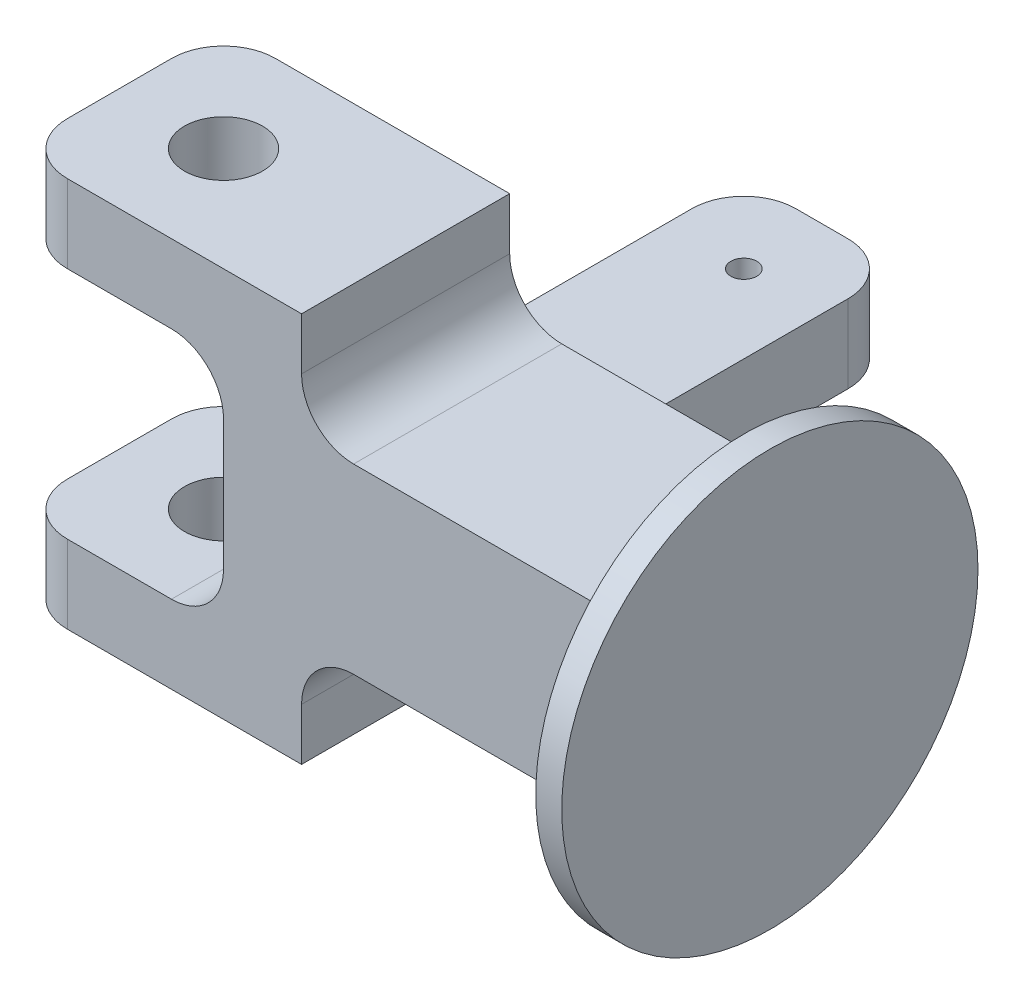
ISO-10303-21;
HEADER;
FILE_DESCRIPTION(('STEP AP214'),'2;1');
FILE_NAME('part.step','',(''),(''),'','','');
FILE_SCHEMA(('AUTOMOTIVE_DESIGN { 1 0 10303 214 1 1 1 1 }'));
ENDSEC;
DATA;
#1=APPLICATION_CONTEXT('core data for automotive mechanical design processes');
#2=APPLICATION_PROTOCOL_DEFINITION('international standard','automotive_design',2000,#1);
#3=PRODUCT_CONTEXT('',#1,'mechanical');
#4=PRODUCT('Part','Part','',(#3));
#5=PRODUCT_RELATED_PRODUCT_CATEGORY('part','',(#4));
#6=PRODUCT_DEFINITION_FORMATION('','',#4);
#7=PRODUCT_DEFINITION_CONTEXT('part definition',#1,'design');
#8=PRODUCT_DEFINITION('design','',#6,#7);
#9=PRODUCT_DEFINITION_SHAPE('','',#8);
#10=(LENGTH_UNIT() NAMED_UNIT(*) SI_UNIT(.MILLI.,.METRE.));
#11=(NAMED_UNIT(*) PLANE_ANGLE_UNIT() SI_UNIT($,.RADIAN.));
#12=(NAMED_UNIT(*) SI_UNIT($,.STERADIAN.) SOLID_ANGLE_UNIT());
#13=UNCERTAINTY_MEASURE_WITH_UNIT(LENGTH_MEASURE(1.E-05),#10,'distance_accuracy_value','');
#14=(GEOMETRIC_REPRESENTATION_CONTEXT(3) GLOBAL_UNCERTAINTY_ASSIGNED_CONTEXT((#13)) GLOBAL_UNIT_ASSIGNED_CONTEXT((#10,
#11,#12)) REPRESENTATION_CONTEXT('',''));
#15=CARTESIAN_POINT('',(0.,0.,0.));
#16=DIRECTION('',(0.,0.,1.));
#17=DIRECTION('',(1.,0.,0.));
#18=AXIS2_PLACEMENT_3D('',#15,#16,#17);
#19=CARTESIAN_POINT('',(-6.34999999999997,-47.624999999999,-82.5499999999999));
#20=DIRECTION('',(0.,-1.,0.));
#21=DIRECTION('',(0.,0.,-1.));
#22=AXIS2_PLACEMENT_3D('',#19,#20,#21);
#23=PLANE('',#22);
#24=CARTESIAN_POINT('',(-50.8,-47.625000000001,0.));
#25=DIRECTION('',(0.,1.,0.));
#26=DIRECTION('',(0.,0.,1.));
#27=AXIS2_PLACEMENT_3D('',#24,#25,#26);
#28=CIRCLE('',#27,9.52500000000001);
#29=CARTESIAN_POINT('',(-50.8,-47.625000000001,9.52500000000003));
#30=VERTEX_POINT('',#29);
#31=EDGE_CURVE('E390',#30,#30,#28,.T.);
#32=ORIENTED_EDGE('',*,*,#31,.T.);
#33=EDGE_LOOP('',(#32));
#34=FACE_BOUND('',#33,.T.);
#35=DIRECTION('',(-1.,0.,0.));
#36=VECTOR('',#35,1.);
#37=CARTESIAN_POINT('',(19.05,-47.624999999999,-25.3999999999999));
#38=LINE('',#37,#36);
#39=CARTESIAN_POINT('',(-6.34999999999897,-47.624999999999,-25.4000000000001));
#40=VERTEX_POINT('',#39);
#41=CARTESIAN_POINT('',(-63.4999999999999,-47.625,-25.3999999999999));
#42=VERTEX_POINT('',#41);
#43=EDGE_CURVE('E400',#40,#42,#38,.T.);
#44=ORIENTED_EDGE('',*,*,#43,.F.);
#45=DIRECTION('',(0.,0.,-1.));
#46=VECTOR('',#45,1.);
#47=CARTESIAN_POINT('',(-6.34999999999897,-47.625,25.3999999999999));
#48=LINE('',#47,#46);
#49=CARTESIAN_POINT('',(-6.34999999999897,-47.625,25.3999999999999));
#50=VERTEX_POINT('',#49);
#51=EDGE_CURVE('E266',#50,#40,#48,.T.);
#52=ORIENTED_EDGE('',*,*,#51,.F.);
#53=DIRECTION('',(1.,0.,0.));
#54=VECTOR('',#53,1.);
#55=CARTESIAN_POINT('',(-63.4999999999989,-47.625000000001,25.4000000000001));
#56=LINE('',#55,#54);
#57=CARTESIAN_POINT('',(-63.4999999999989,-47.625000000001,25.4000000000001));
#58=VERTEX_POINT('',#57);
#59=EDGE_CURVE('E418',#58,#50,#56,.T.);
#60=ORIENTED_EDGE('',*,*,#59,.F.);
#61=CARTESIAN_POINT('',(-63.4999999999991,-47.625000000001,12.6999999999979));
#62=DIRECTION('',(0.,1.,0.));
#63=DIRECTION('',(0.,0.,-1.));
#64=AXIS2_PLACEMENT_3D('',#61,#62,#63);
#65=CIRCLE('',#64,12.7);
#66=CARTESIAN_POINT('',(-76.199999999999,-47.625000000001,12.7000000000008));
#67=VERTEX_POINT('',#66);
#68=EDGE_CURVE('E415',#67,#58,#65,.T.);
#69=ORIENTED_EDGE('',*,*,#68,.F.);
#70=DIRECTION('',(0.,0.,1.));
#71=VECTOR('',#70,1.);
#72=CARTESIAN_POINT('',(-76.199999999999,-47.625000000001,12.7000000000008));
#73=LINE('',#72,#71);
#74=CARTESIAN_POINT('',(-76.1999999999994,-47.625000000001,-12.6999999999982));
#75=VERTEX_POINT('',#74);
#76=EDGE_CURVE('E412',#75,#67,#73,.T.);
#77=ORIENTED_EDGE('',*,*,#76,.F.);
#78=CARTESIAN_POINT('',(-63.4999999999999,-47.625000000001,-12.6999999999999));
#79=DIRECTION('',(0.,1.,0.));
#80=DIRECTION('',(0.,0.,-1.));
#81=AXIS2_PLACEMENT_3D('',#78,#79,#80);
#82=CIRCLE('',#81,12.7);
#83=EDGE_CURVE('E394',#42,#75,#82,.T.);
#84=ORIENTED_EDGE('',*,*,#83,.F.);
#85=EDGE_LOOP('',(#44,#52,#60,#69,#77,#84));
#86=FACE_BOUND('',#85,.T.);
#87=ADVANCED_FACE('F46',(#34,#86),#23,.T.);
#88=CARTESIAN_POINT('',(-63.4999999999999,47.624999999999,25.4000000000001));
#89=DIRECTION('',(0.,0.,-1.));
#90=DIRECTION('',(-1.,0.,0.));
#91=AXIS2_PLACEMENT_3D('',#88,#89,#90);
#92=PLANE('',#91);
#93=DIRECTION('',(-1.,0.,0.));
#94=VECTOR('',#93,1.);
#95=CARTESIAN_POINT('',(76.2000000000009,-22.2250000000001,25.3999999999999));
#96=LINE('',#95,#94);
#97=CARTESIAN_POINT('',(76.2000000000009,-22.2250000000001,25.3999999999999));
#98=VERTEX_POINT('',#97);
#99=CARTESIAN_POINT('',(6.35000000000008,-22.2250000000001,25.4000000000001));
#100=VERTEX_POINT('',#99);
#101=EDGE_CURVE('E268',#98,#100,#96,.T.);
#102=ORIENTED_EDGE('',*,*,#101,.F.);
#103=DIRECTION('',(0.,-1.,0.));
#104=VECTOR('',#103,1.);
#105=CARTESIAN_POINT('',(76.1999999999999,47.625,25.3999999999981));
#106=LINE('',#105,#104);
#107=CARTESIAN_POINT('',(76.2000000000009,22.2250000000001,25.3999999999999));
#108=VERTEX_POINT('',#107);
#109=EDGE_CURVE('E243',#108,#98,#106,.T.);
#110=ORIENTED_EDGE('',*,*,#109,.F.);
#111=DIRECTION('',(-1.,0.,0.));
#112=VECTOR('',#111,1.);
#113=CARTESIAN_POINT('',(76.2000000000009,22.2250000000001,25.3999999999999));
#114=LINE('',#113,#112);
#115=CARTESIAN_POINT('',(6.35000000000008,22.2250000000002,25.4000000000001));
#116=VERTEX_POINT('',#115);
#117=EDGE_CURVE('E269',#108,#116,#114,.T.);
#118=ORIENTED_EDGE('',*,*,#117,.T.);
#119=CARTESIAN_POINT('',(6.34999999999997,34.9250000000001,25.4000000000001));
#120=DIRECTION('',(0.,0.,-1.));
#121=DIRECTION('',(-1.,0.,0.));
#122=AXIS2_PLACEMENT_3D('',#119,#120,#121);
#123=CIRCLE('',#122,12.7);
#124=CARTESIAN_POINT('',(-6.34999999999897,34.9250000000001,25.3999999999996));
#125=VERTEX_POINT('',#124);
#126=EDGE_CURVE('E272',#116,#125,#123,.T.);
#127=ORIENTED_EDGE('',*,*,#126,.T.);
#128=DIRECTION('',(0.,1.,0.));
#129=VECTOR('',#128,1.);
#130=CARTESIAN_POINT('',(-6.34999999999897,34.9250000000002,25.3999999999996));
#131=LINE('',#130,#129);
#132=CARTESIAN_POINT('',(-6.35000000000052,47.625,25.3999999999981));
#133=VERTEX_POINT('',#132);
#134=EDGE_CURVE('E276',#125,#133,#131,.T.);
#135=ORIENTED_EDGE('',*,*,#134,.T.);
#136=DIRECTION('',(1.,0.,0.));
#137=VECTOR('',#136,1.);
#138=CARTESIAN_POINT('',(-63.4999999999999,47.624999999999,25.4000000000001));
#139=LINE('',#138,#137);
#140=CARTESIAN_POINT('',(-63.4999999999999,47.624999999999,25.4000000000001));
#141=VERTEX_POINT('',#140);
#142=EDGE_CURVE('E406',#141,#133,#139,.T.);
#143=ORIENTED_EDGE('',*,*,#142,.F.);
#144=DIRECTION('',(0.,-1.,0.));
#145=VECTOR('',#144,1.);
#146=CARTESIAN_POINT('',(-63.4999999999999,47.624999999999,25.4000000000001));
#147=LINE('',#146,#145);
#148=CARTESIAN_POINT('',(-63.4999999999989,28.574999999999,25.4000000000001));
#149=VERTEX_POINT('',#148);
#150=EDGE_CURVE('E434',#141,#149,#147,.T.);
#151=ORIENTED_EDGE('',*,*,#150,.T.);
#152=DIRECTION('',(-1.,0.,0.));
#153=VECTOR('',#152,1.);
#154=CARTESIAN_POINT('',(-76.1999999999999,28.574999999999,25.4000000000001));
#155=LINE('',#154,#153);
#156=CARTESIAN_POINT('',(-38.0999999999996,28.575,25.4000000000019));
#157=VERTEX_POINT('',#156);
#158=EDGE_CURVE('E346',#157,#149,#155,.T.);
#159=ORIENTED_EDGE('',*,*,#158,.F.);
#160=CARTESIAN_POINT('',(-38.0999999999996,15.875,25.4000000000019));
#161=DIRECTION('',(0.,0.,1.));
#162=DIRECTION('',(-1.,0.,0.));
#163=AXIS2_PLACEMENT_3D('',#160,#161,#162);
#164=CIRCLE('',#163,12.7);
#165=CARTESIAN_POINT('',(-25.3999999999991,15.875,25.3999999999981));
#166=VERTEX_POINT('',#165);
#167=EDGE_CURVE('E343',#166,#157,#164,.T.);
#168=ORIENTED_EDGE('',*,*,#167,.F.);
#169=DIRECTION('',(0.,1.,0.));
#170=VECTOR('',#169,1.);
#171=CARTESIAN_POINT('',(-25.3999999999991,15.875,25.3999999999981));
#172=LINE('',#171,#170);
#173=CARTESIAN_POINT('',(-25.399999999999,-15.875,25.399999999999));
#174=VERTEX_POINT('',#173);
#175=EDGE_CURVE('E340',#174,#166,#172,.T.);
#176=ORIENTED_EDGE('',*,*,#175,.F.);
#177=CARTESIAN_POINT('',(-38.0999999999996,-15.875,25.4000000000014));
#178=DIRECTION('',(0.,0.,1.));
#179=DIRECTION('',(1.,0.,0.));
#180=AXIS2_PLACEMENT_3D('',#177,#178,#179);
#181=CIRCLE('',#180,12.7);
#182=CARTESIAN_POINT('',(-38.1,-28.575,25.3999999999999));
#183=VERTEX_POINT('',#182);
#184=EDGE_CURVE('E337',#183,#174,#181,.T.);
#185=ORIENTED_EDGE('',*,*,#184,.F.);
#186=DIRECTION('',(1.,0.,0.));
#187=VECTOR('',#186,1.);
#188=CARTESIAN_POINT('',(-76.1999999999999,-28.575000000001,25.4000000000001));
#189=LINE('',#188,#187);
#190=CARTESIAN_POINT('',(-63.4999999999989,-28.575000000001,25.4000000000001));
#191=VERTEX_POINT('',#190);
#192=EDGE_CURVE('E334',#191,#183,#189,.T.);
#193=ORIENTED_EDGE('',*,*,#192,.F.);
#194=EDGE_CURVE('E433',#191,#58,#147,.T.);
#195=ORIENTED_EDGE('',*,*,#194,.T.);
#196=ORIENTED_EDGE('',*,*,#59,.T.);
#197=DIRECTION('',(0.,-1.,0.));
#198=VECTOR('',#197,1.);
#199=CARTESIAN_POINT('',(-6.34999999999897,-34.9250000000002,25.3999999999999));
#200=LINE('',#199,#198);
#201=CARTESIAN_POINT('',(-6.34999999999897,-34.9250000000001,25.3999999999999));
#202=VERTEX_POINT('',#201);
#203=EDGE_CURVE('E252',#202,#50,#200,.T.);
#204=ORIENTED_EDGE('',*,*,#203,.F.);
#205=CARTESIAN_POINT('',(6.34999999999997,-34.9250000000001,25.4000000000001));
#206=DIRECTION('',(0.,0.,1.));
#207=DIRECTION('',(-1.,0.,0.));
#208=AXIS2_PLACEMENT_3D('',#205,#206,#207);
#209=CIRCLE('',#208,12.7);
#210=EDGE_CURVE('E522',#100,#202,#209,.T.);
#211=ORIENTED_EDGE('',*,*,#210,.F.);
#212=EDGE_LOOP('',(#102,#110,#118,#127,#135,#143,#151,#159,#168,#176,#185,#193,#195,#196,#204,#211));
#213=FACE_BOUND('',#212,.T.);
#214=ADVANCED_FACE('F519',(#213),#92,.F.);
#215=CARTESIAN_POINT('',(19.049999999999,47.625000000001,-25.3999999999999));
#216=DIRECTION('',(0.,0.,1.));
#217=DIRECTION('',(1.,0.,0.));
#218=AXIS2_PLACEMENT_3D('',#215,#216,#217);
#219=PLANE('',#218);
#220=DIRECTION('',(-1.,0.,0.));
#221=VECTOR('',#220,1.);
#222=CARTESIAN_POINT('',(76.2000000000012,-22.2249999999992,-25.3999999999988));
#223=LINE('',#222,#221);
#224=CARTESIAN_POINT('',(76.2000000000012,-22.2249999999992,-25.3999999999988));
#225=VERTEX_POINT('',#224);
#226=CARTESIAN_POINT('',(19.05,-22.2249999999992,-25.3999999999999));
#227=VERTEX_POINT('',#226);
#228=EDGE_CURVE('E237',#225,#227,#223,.T.);
#229=ORIENTED_EDGE('',*,*,#228,.T.);
#230=DIRECTION('',(0.,-1.,0.));
#231=VECTOR('',#230,1.);
#232=CARTESIAN_POINT('',(19.049999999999,47.625000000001,-25.3999999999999));
#233=LINE('',#232,#231);
#234=CARTESIAN_POINT('',(19.05,22.2250000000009,-25.3999999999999));
#235=VERTEX_POINT('',#234);
#236=EDGE_CURVE('E244',#235,#227,#233,.T.);
#237=ORIENTED_EDGE('',*,*,#236,.F.);
#238=DIRECTION('',(-1.,0.,0.));
#239=VECTOR('',#238,1.);
#240=CARTESIAN_POINT('',(76.2000000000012,22.225000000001,-25.3999999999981));
#241=LINE('',#240,#239);
#242=CARTESIAN_POINT('',(76.2000000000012,22.225000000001,-25.3999999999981));
#243=VERTEX_POINT('',#242);
#244=EDGE_CURVE('E239',#243,#235,#241,.T.);
#245=ORIENTED_EDGE('',*,*,#244,.F.);
#246=DIRECTION('',(0.,-1.,0.));
#247=VECTOR('',#246,1.);
#248=CARTESIAN_POINT('',(76.1999999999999,47.625000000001,-25.3999999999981));
#249=LINE('',#248,#247);
#250=EDGE_CURVE('E233',#243,#225,#249,.T.);
#251=ORIENTED_EDGE('',*,*,#250,.T.);
#252=EDGE_LOOP('',(#229,#237,#245,#251));
#253=FACE_BOUND('',#252,.T.);
#254=ADVANCED_FACE('F235',(#253),#219,.F.);
#255=CARTESIAN_POINT('',(6.35000000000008,-34.9249999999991,-25.4000000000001));
#256=DIRECTION('',(0.,0.,1.));
#257=DIRECTION('',(-1.,0.,0.));
#258=AXIS2_PLACEMENT_3D('',#255,#256,#257);
#259=CIRCLE('',#258,12.7);
#260=CARTESIAN_POINT('',(6.35000000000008,-22.224999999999,-25.4000000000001));
#261=VERTEX_POINT('',#260);
#262=CARTESIAN_POINT('',(-6.34999999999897,-34.9249999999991,-25.4000000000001));
#263=VERTEX_POINT('',#262);
#264=EDGE_CURVE('E61',#261,#263,#259,.T.);
#265=ORIENTED_EDGE('',*,*,#264,.T.);
#266=DIRECTION('',(0.,-1.,0.));
#267=VECTOR('',#266,1.);
#268=CARTESIAN_POINT('',(-6.34999999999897,-34.9249999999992,-25.4000000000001));
#269=LINE('',#268,#267);
#270=EDGE_CURVE('E527',#263,#40,#269,.T.);
#271=ORIENTED_EDGE('',*,*,#270,.T.);
#272=ORIENTED_EDGE('',*,*,#43,.T.);
#273=DIRECTION('',(0.,-1.,0.));
#274=VECTOR('',#273,1.);
#275=CARTESIAN_POINT('',(-63.5000000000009,47.625,-25.3999999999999));
#276=LINE('',#275,#274);
#277=CARTESIAN_POINT('',(-63.4999999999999,-28.575,-25.3999999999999));
#278=VERTEX_POINT('',#277);
#279=EDGE_CURVE('E445',#278,#42,#276,.T.);
#280=ORIENTED_EDGE('',*,*,#279,.F.);
#281=DIRECTION('',(1.,0.,0.));
#282=VECTOR('',#281,1.);
#283=CARTESIAN_POINT('',(-19.05,-28.574999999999,-25.4000000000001));
#284=LINE('',#283,#282);
#285=CARTESIAN_POINT('',(-38.0999999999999,-28.574999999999,-25.4000000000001));
#286=VERTEX_POINT('',#285);
#287=EDGE_CURVE('E368',#278,#286,#284,.T.);
#288=ORIENTED_EDGE('',*,*,#287,.T.);
#289=CARTESIAN_POINT('',(-38.0999999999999,-15.874999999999,-25.4000000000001));
#290=DIRECTION('',(0.,0.,1.));
#291=DIRECTION('',(1.,0.,0.));
#292=AXIS2_PLACEMENT_3D('',#289,#290,#291);
#293=CIRCLE('',#292,12.7);
#294=CARTESIAN_POINT('',(-25.3999999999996,-15.874999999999,-25.3999999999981));
#295=VERTEX_POINT('',#294);
#296=EDGE_CURVE('E381',#286,#295,#293,.T.);
#297=ORIENTED_EDGE('',*,*,#296,.T.);
#298=DIRECTION('',(0.,1.,0.));
#299=VECTOR('',#298,1.);
#300=CARTESIAN_POINT('',(-25.400000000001,47.625000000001,-25.3999999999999));
#301=LINE('',#300,#299);
#302=CARTESIAN_POINT('',(-25.4,15.875000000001,-25.3999999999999));
#303=VERTEX_POINT('',#302);
#304=EDGE_CURVE('E384',#295,#303,#301,.T.);
#305=ORIENTED_EDGE('',*,*,#304,.T.);
#306=CARTESIAN_POINT('',(-38.0999999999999,15.875000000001,-25.4000000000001));
#307=DIRECTION('',(0.,0.,1.));
#308=DIRECTION('',(1.,0.,0.));
#309=AXIS2_PLACEMENT_3D('',#306,#307,#308);
#310=CIRCLE('',#309,12.7);
#311=CARTESIAN_POINT('',(-38.0999999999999,28.575000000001,-25.4000000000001));
#312=VERTEX_POINT('',#311);
#313=EDGE_CURVE('E387',#303,#312,#310,.T.);
#314=ORIENTED_EDGE('',*,*,#313,.T.);
#315=DIRECTION('',(-1.,0.,0.));
#316=VECTOR('',#315,1.);
#317=CARTESIAN_POINT('',(-19.05,28.575000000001,-25.4000000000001));
#318=LINE('',#317,#316);
#319=CARTESIAN_POINT('',(-63.4999999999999,28.575,-25.3999999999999));
#320=VERTEX_POINT('',#319);
#321=EDGE_CURVE('E378',#312,#320,#318,.T.);
#322=ORIENTED_EDGE('',*,*,#321,.T.);
#323=CARTESIAN_POINT('',(-63.5000000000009,47.625,-25.3999999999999));
#324=VERTEX_POINT('',#323);
#325=EDGE_CURVE('E446',#324,#320,#276,.T.);
#326=ORIENTED_EDGE('',*,*,#325,.F.);
#327=DIRECTION('',(-1.,0.,0.));
#328=VECTOR('',#327,1.);
#329=CARTESIAN_POINT('',(-19.050000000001,47.625000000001,-25.4000000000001));
#330=LINE('',#329,#328);
#331=CARTESIAN_POINT('',(-6.34999999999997,47.625000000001,-25.3999999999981));
#332=VERTEX_POINT('',#331);
#333=EDGE_CURVE('E397',#332,#324,#330,.T.);
#334=ORIENTED_EDGE('',*,*,#333,.F.);
#335=DIRECTION('',(0.,1.,0.));
#336=VECTOR('',#335,1.);
#337=CARTESIAN_POINT('',(-6.34999999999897,34.9250000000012,-25.3999999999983));
#338=LINE('',#337,#336);
#339=CARTESIAN_POINT('',(-6.34999999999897,34.9250000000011,-25.3999999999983));
#340=VERTEX_POINT('',#339);
#341=EDGE_CURVE('E273',#340,#332,#338,.T.);
#342=ORIENTED_EDGE('',*,*,#341,.F.);
#343=CARTESIAN_POINT('',(6.3500000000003,34.9250000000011,-25.4000000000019));
#344=DIRECTION('',(0.,0.,-1.));
#345=DIRECTION('',(-1.,0.,0.));
#346=AXIS2_PLACEMENT_3D('',#343,#344,#345);
#347=CIRCLE('',#346,12.7);
#348=CARTESIAN_POINT('',(6.3500000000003,22.225000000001,-25.4000000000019));
#349=VERTEX_POINT('',#348);
#350=EDGE_CURVE('E259',#349,#340,#347,.T.);
#351=ORIENTED_EDGE('',*,*,#350,.F.);
#352=DIRECTION('',(-1.,0.,0.));
#353=VECTOR('',#352,1.);
#354=CARTESIAN_POINT('',(76.2000000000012,22.2250000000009,-25.3999999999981));
#355=LINE('',#354,#353);
#356=CARTESIAN_POINT('',(-19.05,22.2250000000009,-25.4000000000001));
#357=VERTEX_POINT('',#356);
#358=EDGE_CURVE('E321',#349,#357,#355,.T.);
#359=ORIENTED_EDGE('',*,*,#358,.T.);
#360=DIRECTION('',(0.,-1.,0.));
#361=VECTOR('',#360,1.);
#362=CARTESIAN_POINT('',(-19.050000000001,47.625000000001,-25.4000000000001));
#363=LINE('',#362,#361);
#364=CARTESIAN_POINT('',(-19.05,-22.224999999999,-25.4000000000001));
#365=VERTEX_POINT('',#364);
#366=EDGE_CURVE('E449',#357,#365,#363,.T.);
#367=ORIENTED_EDGE('',*,*,#366,.T.);
#368=DIRECTION('',(-1.,0.,0.));
#369=VECTOR('',#368,1.);
#370=CARTESIAN_POINT('',(76.2000000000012,-22.224999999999,-25.3999999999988));
#371=LINE('',#370,#369);
#372=EDGE_CURVE('E297',#261,#365,#371,.T.);
#373=ORIENTED_EDGE('',*,*,#372,.F.);
#374=EDGE_LOOP('',(#265,#271,#272,#280,#288,#297,#305,#314,#322,#326,#334,#342,#351,#359,#367,#373));
#375=FACE_BOUND('',#374,.T.);
#376=ADVANCED_FACE('F507',(#375),#219,.F.);
#377=CARTESIAN_POINT('',(-63.5000000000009,47.624999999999,-12.6999999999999));
#378=DIRECTION('',(0.,-1.,0.));
#379=DIRECTION('',(0.,0.,-1.));
#380=AXIS2_PLACEMENT_3D('',#377,#378,#379);
#381=CYLINDRICAL_SURFACE('',#380,12.7);
#382=ORIENTED_EDGE('',*,*,#325,.T.);
#383=CARTESIAN_POINT('',(-63.4999999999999,28.574999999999,-12.6999999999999));
#384=DIRECTION('',(0.,1.,0.));
#385=DIRECTION('',(-1.,0.,0.));
#386=AXIS2_PLACEMENT_3D('',#383,#384,#385);
#387=CIRCLE('',#386,12.7);
#388=CARTESIAN_POINT('',(-76.2,28.574999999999,-12.6999999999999));
#389=VERTEX_POINT('',#388);
#390=EDGE_CURVE('E375',#320,#389,#387,.T.);
#391=ORIENTED_EDGE('',*,*,#390,.T.);
#392=DIRECTION('',(0.,-1.,0.));
#393=VECTOR('',#392,1.);
#394=CARTESIAN_POINT('',(-76.200000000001,47.624999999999,-12.6999999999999));
#395=LINE('',#394,#393);
#396=CARTESIAN_POINT('',(-76.200000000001,47.624999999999,-12.6999999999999));
#397=VERTEX_POINT('',#396);
#398=EDGE_CURVE('E442',#397,#389,#395,.T.);
#399=ORIENTED_EDGE('',*,*,#398,.F.);
#400=CARTESIAN_POINT('',(-63.5000000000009,47.624999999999,-12.6999999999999));
#401=DIRECTION('',(0.,1.,0.));
#402=DIRECTION('',(0.,0.,-1.));
#403=AXIS2_PLACEMENT_3D('',#400,#401,#402);
#404=CIRCLE('',#403,12.7);
#405=EDGE_CURVE('E399',#324,#397,#404,.T.);
#406=ORIENTED_EDGE('',*,*,#405,.F.);
#407=EDGE_LOOP('',(#382,#391,#399,#406));
#408=FACE_BOUND('',#407,.T.);
#409=ADVANCED_FACE('F581',(#408),#381,.T.);
#410=CARTESIAN_POINT('',(-76.2,47.624999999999,12.6999999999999));
#411=DIRECTION('',(1.,0.,0.));
#412=DIRECTION('',(0.,0.,-1.));
#413=AXIS2_PLACEMENT_3D('',#410,#411,#412);
#414=PLANE('',#413);
#415=ORIENTED_EDGE('',*,*,#398,.T.);
#416=DIRECTION('',(0.,0.,1.));
#417=VECTOR('',#416,1.);
#418=CARTESIAN_POINT('',(-76.1999999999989,28.5749999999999,-95.2500000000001));
#419=LINE('',#418,#417);
#420=CARTESIAN_POINT('',(-76.1999999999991,28.574999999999,12.7000000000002));
#421=VERTEX_POINT('',#420);
#422=EDGE_CURVE('E349',#389,#421,#419,.T.);
#423=ORIENTED_EDGE('',*,*,#422,.T.);
#424=DIRECTION('',(0.,-1.,0.));
#425=VECTOR('',#424,1.);
#426=CARTESIAN_POINT('',(-76.2,47.624999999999,12.6999999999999));
#427=LINE('',#426,#425);
#428=CARTESIAN_POINT('',(-76.2,47.624999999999,12.6999999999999));
#429=VERTEX_POINT('',#428);
#430=EDGE_CURVE('E438',#429,#421,#427,.T.);
#431=ORIENTED_EDGE('',*,*,#430,.F.);
#432=DIRECTION('',(0.,0.,1.));
#433=VECTOR('',#432,1.);
#434=CARTESIAN_POINT('',(-76.2,47.624999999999,12.6999999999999));
#435=LINE('',#434,#433);
#436=EDGE_CURVE('E402',#397,#429,#435,.T.);
#437=ORIENTED_EDGE('',*,*,#436,.F.);
#438=EDGE_LOOP('',(#415,#423,#431,#437));
#439=FACE_BOUND('',#438,.T.);
#440=ADVANCED_FACE('F585',(#439),#414,.F.);
#441=CARTESIAN_POINT('',(-63.5,47.624999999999,12.6999999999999));
#442=DIRECTION('',(0.,-1.,0.));
#443=DIRECTION('',(0.,0.,-1.));
#444=AXIS2_PLACEMENT_3D('',#441,#442,#443);
#445=CYLINDRICAL_SURFACE('',#444,12.7);
#446=ORIENTED_EDGE('',*,*,#430,.T.);
#447=CARTESIAN_POINT('',(-63.4999999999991,28.574999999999,12.6999999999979));
#448=DIRECTION('',(0.,1.,0.));
#449=DIRECTION('',(-1.,0.,0.));
#450=AXIS2_PLACEMENT_3D('',#447,#448,#449);
#451=CIRCLE('',#450,12.7);
#452=EDGE_CURVE('E372',#421,#149,#451,.T.);
#453=ORIENTED_EDGE('',*,*,#452,.T.);
#454=ORIENTED_EDGE('',*,*,#150,.F.);
#455=CARTESIAN_POINT('',(-63.5,47.624999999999,12.6999999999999));
#456=DIRECTION('',(0.,1.,0.));
#457=DIRECTION('',(0.,0.,-1.));
#458=AXIS2_PLACEMENT_3D('',#455,#456,#457);
#459=CIRCLE('',#458,12.7);
#460=EDGE_CURVE('E404',#429,#141,#459,.T.);
#461=ORIENTED_EDGE('',*,*,#460,.F.);
#462=EDGE_LOOP('',(#446,#453,#454,#461));
#463=FACE_BOUND('',#462,.T.);
#464=ADVANCED_FACE('F596',(#463),#445,.T.);
#465=CARTESIAN_POINT('',(-50.800000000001,47.624999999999,0.));
#466=DIRECTION('',(0.,-1.,0.));
#467=DIRECTION('',(0.,0.,-1.));
#468=AXIS2_PLACEMENT_3D('',#465,#466,#467);
#469=CYLINDRICAL_SURFACE('',#468,9.52500000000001);
#470=CARTESIAN_POINT('',(-50.8,28.574999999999,0.));
#471=DIRECTION('',(0.,1.,0.));
#472=DIRECTION('',(-1.,0.,0.));
#473=AXIS2_PLACEMENT_3D('',#470,#471,#472);
#474=CIRCLE('',#473,9.52500000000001);
#475=CARTESIAN_POINT('',(-60.325,28.574999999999,0.));
#476=VERTEX_POINT('',#475);
#477=EDGE_CURVE('E371',#476,#476,#474,.T.);
#478=ORIENTED_EDGE('',*,*,#477,.F.);
#479=EDGE_LOOP('',(#478));
#480=FACE_BOUND('',#479,.T.);
#481=CARTESIAN_POINT('',(-50.800000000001,47.624999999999,0.));
#482=DIRECTION('',(0.,1.,0.));
#483=DIRECTION('',(0.,0.,1.));
#484=AXIS2_PLACEMENT_3D('',#481,#482,#483);
#485=CIRCLE('',#484,9.52500000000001);
#486=CARTESIAN_POINT('',(-50.800000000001,47.624999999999,9.52500000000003));
#487=VERTEX_POINT('',#486);
#488=EDGE_CURVE('E391',#487,#487,#485,.T.);
#489=ORIENTED_EDGE('',*,*,#488,.T.);
#490=EDGE_LOOP('',(#489));
#491=FACE_BOUND('',#490,.T.);
#492=ADVANCED_FACE('F598',(#480,#491),#469,.F.);
#493=CARTESIAN_POINT('',(-6.3500000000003,47.6250000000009,-82.5499999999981));
#494=DIRECTION('',(0.,-1.,0.));
#495=DIRECTION('',(0.,0.,-1.));
#496=AXIS2_PLACEMENT_3D('',#493,#494,#495);
#497=PLANE('',#496);
#498=ORIENTED_EDGE('',*,*,#142,.T.);
#499=DIRECTION('',(0.,0.,-1.));
#500=VECTOR('',#499,1.);
#501=CARTESIAN_POINT('',(-6.35000000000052,47.625,25.3999999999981));
#502=LINE('',#501,#500);
#503=EDGE_CURVE('E283',#133,#332,#502,.T.);
#504=ORIENTED_EDGE('',*,*,#503,.T.);
#505=ORIENTED_EDGE('',*,*,#333,.T.);
#506=ORIENTED_EDGE('',*,*,#405,.T.);
#507=ORIENTED_EDGE('',*,*,#436,.T.);
#508=ORIENTED_EDGE('',*,*,#460,.T.);
#509=EDGE_LOOP('',(#498,#504,#505,#506,#507,#508));
#510=FACE_BOUND('',#509,.T.);
#511=ORIENTED_EDGE('',*,*,#488,.F.);
#512=EDGE_LOOP('',(#511));
#513=FACE_BOUND('',#512,.T.);
#514=ADVANCED_FACE('F589',(#510,#513),#497,.F.);
#515=CARTESIAN_POINT('',(-6.3500000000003,47.6250000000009,-82.5499999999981));
#516=DIRECTION('',(0.,-1.,0.));
#517=DIRECTION('',(0.,0.,-1.));
#518=AXIS2_PLACEMENT_3D('',#515,#516,#517);
#519=CYLINDRICAL_SURFACE('',#518,12.7);
#520=DIRECTION('',(0.,-1.,0.));
#521=VECTOR('',#520,1.);
#522=CARTESIAN_POINT('',(-6.35000000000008,47.6250000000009,-95.2500000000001));
#523=LINE('',#522,#521);
#524=CARTESIAN_POINT('',(-6.34999999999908,9.525000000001,-95.2500000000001));
#525=VERTEX_POINT('',#524);
#526=CARTESIAN_POINT('',(-6.34999999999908,-9.52499999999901,-95.2500000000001));
#527=VERTEX_POINT('',#526);
#528=EDGE_CURVE('E409',#525,#527,#523,.T.);
#529=ORIENTED_EDGE('',*,*,#528,.T.);
#530=CARTESIAN_POINT('',(-6.34999999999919,-9.52499999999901,-82.5499999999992));
#531=DIRECTION('',(0.,1.,0.));
#532=DIRECTION('',(0.,0.,1.));
#533=AXIS2_PLACEMENT_3D('',#530,#531,#532);
#534=CIRCLE('',#533,12.7);
#535=CARTESIAN_POINT('',(-19.049999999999,-9.52499999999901,-82.5499999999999));
#536=VERTEX_POINT('',#535);
#537=EDGE_CURVE('E69',#527,#536,#534,.T.);
#538=ORIENTED_EDGE('',*,*,#537,.T.);
#539=DIRECTION('',(0.,-1.,0.));
#540=VECTOR('',#539,1.);
#541=CARTESIAN_POINT('',(-19.05,47.6250000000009,-82.5500000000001));
#542=LINE('',#541,#540);
#543=CARTESIAN_POINT('',(-19.049999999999,9.525000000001,-82.5499999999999));
#544=VERTEX_POINT('',#543);
#545=EDGE_CURVE('E452',#544,#536,#542,.T.);
#546=ORIENTED_EDGE('',*,*,#545,.F.);
#547=CARTESIAN_POINT('',(-6.34999999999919,9.525000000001,-82.5499999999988));
#548=DIRECTION('',(0.,-1.,0.));
#549=DIRECTION('',(0.,0.,-1.));
#550=AXIS2_PLACEMENT_3D('',#547,#548,#549);
#551=CIRCLE('',#550,12.7);
#552=EDGE_CURVE('E331',#544,#525,#551,.T.);
#553=ORIENTED_EDGE('',*,*,#552,.T.);
#554=EDGE_LOOP('',(#529,#538,#546,#553));
#555=FACE_BOUND('',#554,.T.);
#556=ADVANCED_FACE('F48',(#555),#519,.T.);
#557=CARTESIAN_POINT('',(-19.05,47.6250000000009,-82.5500000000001));
#558=DIRECTION('',(1.,0.,0.));
#559=DIRECTION('',(0.,0.,-1.));
#560=AXIS2_PLACEMENT_3D('',#557,#558,#559);
#561=PLANE('',#560);
#562=ORIENTED_EDGE('',*,*,#545,.T.);
#563=DIRECTION('',(0.,0.,-1.));
#564=VECTOR('',#563,1.);
#565=CARTESIAN_POINT('',(-19.049999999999,-9.52499999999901,-38.1));
#566=LINE('',#565,#564);
#567=CARTESIAN_POINT('',(-19.049999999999,-9.52499999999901,-38.1));
#568=VERTEX_POINT('',#567);
#569=EDGE_CURVE('E295',#568,#536,#566,.T.);
#570=ORIENTED_EDGE('',*,*,#569,.F.);
#571=CARTESIAN_POINT('',(-19.049999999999,-22.224999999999,-38.1));
#572=DIRECTION('',(-1.,0.,0.));
#573=DIRECTION('',(0.,0.,-1.));
#574=AXIS2_PLACEMENT_3D('',#571,#572,#573);
#575=CIRCLE('',#574,12.7);
#576=EDGE_CURVE('E286',#365,#568,#575,.T.);
#577=ORIENTED_EDGE('',*,*,#576,.F.);
#578=ORIENTED_EDGE('',*,*,#366,.F.);
#579=CARTESIAN_POINT('',(-19.049999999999,22.2250000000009,-38.1));
#580=DIRECTION('',(-1.,0.,0.));
#581=DIRECTION('',(0.,0.,1.));
#582=AXIS2_PLACEMENT_3D('',#579,#580,#581);
#583=CIRCLE('',#582,12.7);
#584=CARTESIAN_POINT('',(-19.049999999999,9.525000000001,-38.1));
#585=VERTEX_POINT('',#584);
#586=EDGE_CURVE('E314',#585,#357,#583,.T.);
#587=ORIENTED_EDGE('',*,*,#586,.F.);
#588=DIRECTION('',(0.,0.,1.));
#589=VECTOR('',#588,1.);
#590=CARTESIAN_POINT('',(-19.049999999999,9.525000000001,-95.2500000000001));
#591=LINE('',#590,#589);
#592=EDGE_CURVE('E311',#544,#585,#591,.T.);
#593=ORIENTED_EDGE('',*,*,#592,.F.);
#594=EDGE_LOOP('',(#562,#570,#577,#578,#587,#593));
#595=FACE_BOUND('',#594,.T.);
#596=ADVANCED_FACE('F487',(#595),#561,.F.);
#597=CARTESIAN_POINT('',(-76.1999999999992,-28.575000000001,-12.6999999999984));
#598=VERTEX_POINT('',#597);
#599=EDGE_CURVE('E441',#598,#75,#395,.T.);
#600=ORIENTED_EDGE('',*,*,#599,.F.);
#601=CARTESIAN_POINT('',(-63.4999999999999,-28.575000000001,-12.6999999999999));
#602=DIRECTION('',(0.,-1.,0.));
#603=DIRECTION('',(1.,0.,0.));
#604=AXIS2_PLACEMENT_3D('',#601,#602,#603);
#605=CIRCLE('',#604,12.7);
#606=EDGE_CURVE('E365',#598,#278,#605,.T.);
#607=ORIENTED_EDGE('',*,*,#606,.T.);
#608=ORIENTED_EDGE('',*,*,#279,.T.);
#609=ORIENTED_EDGE('',*,*,#83,.T.);
#610=EDGE_LOOP('',(#600,#607,#608,#609));
#611=FACE_BOUND('',#610,.T.);
#612=ADVANCED_FACE('F559',(#611),#381,.T.);
#613=CARTESIAN_POINT('',(-76.1999999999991,-28.575000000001,12.7000000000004));
#614=VERTEX_POINT('',#613);
#615=EDGE_CURVE('E437',#614,#67,#427,.T.);
#616=ORIENTED_EDGE('',*,*,#615,.F.);
#617=DIRECTION('',(0.,0.,1.));
#618=VECTOR('',#617,1.);
#619=CARTESIAN_POINT('',(-76.1999999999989,-28.575,-95.2500000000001));
#620=LINE('',#619,#618);
#621=EDGE_CURVE('E348',#598,#614,#620,.T.);
#622=ORIENTED_EDGE('',*,*,#621,.F.);
#623=ORIENTED_EDGE('',*,*,#599,.T.);
#624=ORIENTED_EDGE('',*,*,#76,.T.);
#625=EDGE_LOOP('',(#616,#622,#623,#624));
#626=FACE_BOUND('',#625,.T.);
#627=ADVANCED_FACE('F554',(#626),#414,.F.);
#628=ORIENTED_EDGE('',*,*,#194,.F.);
#629=CARTESIAN_POINT('',(-63.4999999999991,-28.575000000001,12.6999999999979));
#630=DIRECTION('',(0.,-1.,0.));
#631=DIRECTION('',(1.,0.,0.));
#632=AXIS2_PLACEMENT_3D('',#629,#630,#631);
#633=CIRCLE('',#632,12.7);
#634=EDGE_CURVE('E362',#191,#614,#633,.T.);
#635=ORIENTED_EDGE('',*,*,#634,.T.);
#636=ORIENTED_EDGE('',*,*,#615,.T.);
#637=ORIENTED_EDGE('',*,*,#68,.T.);
#638=EDGE_LOOP('',(#628,#635,#636,#637));
#639=FACE_BOUND('',#638,.T.);
#640=ADVANCED_FACE('F550',(#639),#445,.T.);
#641=CARTESIAN_POINT('',(19.05,47.6250000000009,-82.5499999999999));
#642=DIRECTION('',(-1.,0.,0.));
#643=DIRECTION('',(0.,0.,1.));
#644=AXIS2_PLACEMENT_3D('',#641,#642,#643);
#645=PLANE('',#644);
#646=CARTESIAN_POINT('',(19.0500000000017,-22.224999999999,-38.0999999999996));
#647=DIRECTION('',(-1.,0.,0.));
#648=DIRECTION('',(0.,0.,1.));
#649=AXIS2_PLACEMENT_3D('',#646,#647,#648);
#650=CIRCLE('',#649,12.7);
#651=CARTESIAN_POINT('',(19.050000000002,-9.52499999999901,-38.0999999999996));
#652=VERTEX_POINT('',#651);
#653=EDGE_CURVE('E13',#227,#652,#650,.T.);
#654=ORIENTED_EDGE('',*,*,#653,.T.);
#655=DIRECTION('',(0.,0.,-1.));
#656=VECTOR('',#655,1.);
#657=CARTESIAN_POINT('',(19.050000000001,-9.52499999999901,-82.5499999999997));
#658=LINE('',#657,#656);
#659=CARTESIAN_POINT('',(19.050000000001,-9.52499999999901,-82.5499999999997));
#660=VERTEX_POINT('',#659);
#661=EDGE_CURVE('E307',#652,#660,#658,.T.);
#662=ORIENTED_EDGE('',*,*,#661,.T.);
#663=DIRECTION('',(0.,-1.,0.));
#664=VECTOR('',#663,1.);
#665=CARTESIAN_POINT('',(19.05,47.6250000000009,-82.5499999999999));
#666=LINE('',#665,#664);
#667=CARTESIAN_POINT('',(19.050000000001,9.525000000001,-82.5499999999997));
#668=VERTEX_POINT('',#667);
#669=EDGE_CURVE('E427',#668,#660,#666,.T.);
#670=ORIENTED_EDGE('',*,*,#669,.F.);
#671=DIRECTION('',(0.,0.,1.));
#672=VECTOR('',#671,1.);
#673=CARTESIAN_POINT('',(19.050000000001,9.525000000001,-82.5499999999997));
#674=LINE('',#673,#672);
#675=CARTESIAN_POINT('',(19.0500000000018,9.525000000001,-38.1));
#676=VERTEX_POINT('',#675);
#677=EDGE_CURVE('E328',#668,#676,#674,.T.);
#678=ORIENTED_EDGE('',*,*,#677,.T.);
#679=CARTESIAN_POINT('',(19.050000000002,22.2250000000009,-38.1));
#680=DIRECTION('',(-1.,0.,0.));
#681=DIRECTION('',(0.,0.,1.));
#682=AXIS2_PLACEMENT_3D('',#679,#680,#681);
#683=CIRCLE('',#682,12.7);
#684=EDGE_CURVE('E54',#676,#235,#683,.T.);
#685=ORIENTED_EDGE('',*,*,#684,.T.);
#686=ORIENTED_EDGE('',*,*,#236,.T.);
#687=EDGE_LOOP('',(#654,#662,#670,#678,#685,#686));
#688=FACE_BOUND('',#687,.T.);
#689=ADVANCED_FACE('F493',(#688),#645,.F.);
#690=CARTESIAN_POINT('',(6.34999999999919,47.6250000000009,-82.5500000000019));
#691=DIRECTION('',(0.,-1.,0.));
#692=DIRECTION('',(0.,0.,-1.));
#693=AXIS2_PLACEMENT_3D('',#690,#691,#692);
#694=CYLINDRICAL_SURFACE('',#693,12.7);
#695=ORIENTED_EDGE('',*,*,#669,.T.);
#696=CARTESIAN_POINT('',(6.34999999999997,-9.52499999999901,-82.5500000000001));
#697=DIRECTION('',(0.,1.,0.));
#698=DIRECTION('',(0.,0.,1.));
#699=AXIS2_PLACEMENT_3D('',#696,#697,#698);
#700=CIRCLE('',#699,12.7);
#701=CARTESIAN_POINT('',(6.35000000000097,-9.52499999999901,-95.2500000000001));
#702=VERTEX_POINT('',#701);
#703=EDGE_CURVE('E304',#660,#702,#700,.T.);
#704=ORIENTED_EDGE('',*,*,#703,.T.);
#705=DIRECTION('',(0.,-1.,0.));
#706=VECTOR('',#705,1.);
#707=CARTESIAN_POINT('',(6.34999999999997,47.6250000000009,-95.2500000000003));
#708=LINE('',#707,#706);
#709=CARTESIAN_POINT('',(6.35000000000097,9.52500000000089,-95.2500000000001));
#710=VERTEX_POINT('',#709);
#711=EDGE_CURVE('E424',#710,#702,#708,.T.);
#712=ORIENTED_EDGE('',*,*,#711,.F.);
#713=CARTESIAN_POINT('',(6.34999999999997,9.525000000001,-82.5500000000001));
#714=DIRECTION('',(0.,-1.,0.));
#715=DIRECTION('',(0.,0.,-1.));
#716=AXIS2_PLACEMENT_3D('',#713,#714,#715);
#717=CIRCLE('',#716,12.7);
#718=EDGE_CURVE('E325',#710,#668,#717,.T.);
#719=ORIENTED_EDGE('',*,*,#718,.T.);
#720=EDGE_LOOP('',(#695,#704,#712,#719));
#721=FACE_BOUND('',#720,.T.);
#722=ADVANCED_FACE('F498',(#721),#694,.T.);
#723=CARTESIAN_POINT('',(-6.35000000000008,47.6250000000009,-95.2500000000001));
#724=DIRECTION('',(0.,0.,1.));
#725=DIRECTION('',(1.,0.,0.));
#726=AXIS2_PLACEMENT_3D('',#723,#724,#725);
#727=PLANE('',#726);
#728=ORIENTED_EDGE('',*,*,#711,.T.);
#729=DIRECTION('',(-1.,0.,0.));
#730=VECTOR('',#729,1.);
#731=CARTESIAN_POINT('',(76.2,-9.52499999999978,-95.2500000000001));
#732=LINE('',#731,#730);
#733=EDGE_CURVE('E298',#702,#527,#732,.T.);
#734=ORIENTED_EDGE('',*,*,#733,.T.);
#735=ORIENTED_EDGE('',*,*,#528,.F.);
#736=DIRECTION('',(-1.,0.,0.));
#737=VECTOR('',#736,1.);
#738=CARTESIAN_POINT('',(76.2,9.52500000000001,-95.2500000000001));
#739=LINE('',#738,#737);
#740=EDGE_CURVE('E317',#710,#525,#739,.T.);
#741=ORIENTED_EDGE('',*,*,#740,.F.);
#742=EDGE_LOOP('',(#728,#734,#735,#741));
#743=FACE_BOUND('',#742,.T.);
#744=ADVANCED_FACE('F471',(#743),#727,.F.);
#745=CARTESIAN_POINT('',(0.,47.6250000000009,-76.200000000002));
#746=DIRECTION('',(0.,-1.,0.));
#747=DIRECTION('',(0.,0.,-1.));
#748=AXIS2_PLACEMENT_3D('',#745,#746,#747);
#749=CYLINDRICAL_SURFACE('',#748,3.175);
#750=CARTESIAN_POINT('',(8.88178419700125E-13,-9.52499999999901,-76.200000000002));
#751=DIRECTION('',(0.,1.,0.));
#752=DIRECTION('',(0.,0.,1.));
#753=AXIS2_PLACEMENT_3D('',#750,#751,#752);
#754=CIRCLE('',#753,3.175);
#755=CARTESIAN_POINT('',(8.88266543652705E-13,-9.52499999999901,-73.025000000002));
#756=VERTEX_POINT('',#755);
#757=EDGE_CURVE('E300',#756,#756,#754,.T.);
#758=ORIENTED_EDGE('',*,*,#757,.F.);
#759=EDGE_LOOP('',(#758));
#760=FACE_BOUND('',#759,.T.);
#761=CARTESIAN_POINT('',(8.88178419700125E-13,9.525000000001,-76.200000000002));
#762=DIRECTION('',(0.,-1.,0.));
#763=DIRECTION('',(0.,0.,-1.));
#764=AXIS2_PLACEMENT_3D('',#761,#762,#763);
#765=CIRCLE('',#764,3.175);
#766=CARTESIAN_POINT('',(8.88090295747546E-13,9.525000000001,-79.3750000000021));
#767=VERTEX_POINT('',#766);
#768=EDGE_CURVE('E320',#767,#767,#765,.T.);
#769=ORIENTED_EDGE('',*,*,#768,.F.);
#770=EDGE_LOOP('',(#769));
#771=FACE_BOUND('',#770,.T.);
#772=ADVANCED_FACE('F467',(#760,#771),#749,.F.);
#773=CARTESIAN_POINT('',(-50.8,-28.575000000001,0.));
#774=DIRECTION('',(0.,-1.,0.));
#775=DIRECTION('',(1.,0.,0.));
#776=AXIS2_PLACEMENT_3D('',#773,#774,#775);
#777=CIRCLE('',#776,9.52500000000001);
#778=CARTESIAN_POINT('',(-41.2749999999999,-28.575000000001,0.));
#779=VERTEX_POINT('',#778);
#780=EDGE_CURVE('E352',#779,#779,#777,.T.);
#781=ORIENTED_EDGE('',*,*,#780,.F.);
#782=EDGE_LOOP('',(#781));
#783=FACE_BOUND('',#782,.T.);
#784=ORIENTED_EDGE('',*,*,#31,.F.);
#785=EDGE_LOOP('',(#784));
#786=FACE_BOUND('',#785,.T.);
#787=ADVANCED_FACE('F470',(#783,#786),#469,.F.);
#788=CARTESIAN_POINT('',(-38.099999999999,15.875000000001,-95.2500000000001));
#789=DIRECTION('',(0.,0.,1.));
#790=DIRECTION('',(1.,0.,0.));
#791=AXIS2_PLACEMENT_3D('',#788,#789,#790);
#792=CYLINDRICAL_SURFACE('',#791,12.7);
#793=DIRECTION('',(0.,0.,1.));
#794=VECTOR('',#793,1.);
#795=CARTESIAN_POINT('',(-25.399999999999,15.875000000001,-95.2500000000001));
#796=LINE('',#795,#794);
#797=EDGE_CURVE('E355',#303,#166,#796,.T.);
#798=ORIENTED_EDGE('',*,*,#797,.T.);
#799=ORIENTED_EDGE('',*,*,#167,.T.);
#800=DIRECTION('',(0.,0.,1.));
#801=VECTOR('',#800,1.);
#802=CARTESIAN_POINT('',(-38.099999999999,28.5750000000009,-95.2500000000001));
#803=LINE('',#802,#801);
#804=EDGE_CURVE('E353',#312,#157,#803,.T.);
#805=ORIENTED_EDGE('',*,*,#804,.F.);
#806=ORIENTED_EDGE('',*,*,#313,.F.);
#807=EDGE_LOOP('',(#798,#799,#805,#806));
#808=FACE_BOUND('',#807,.T.);
#809=ADVANCED_FACE('F575',(#808),#792,.F.);
#810=CARTESIAN_POINT('',(-25.399999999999,15.875000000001,-95.2500000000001));
#811=DIRECTION('',(1.,0.,0.));
#812=DIRECTION('',(0.,1.,0.));
#813=AXIS2_PLACEMENT_3D('',#810,#811,#812);
#814=PLANE('',#813);
#815=DIRECTION('',(0.,0.,1.));
#816=VECTOR('',#815,1.);
#817=CARTESIAN_POINT('',(-25.399999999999,-15.8749999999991,-95.2500000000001));
#818=LINE('',#817,#816);
#819=EDGE_CURVE('E357',#295,#174,#818,.T.);
#820=ORIENTED_EDGE('',*,*,#819,.T.);
#821=ORIENTED_EDGE('',*,*,#175,.T.);
#822=ORIENTED_EDGE('',*,*,#797,.F.);
#823=ORIENTED_EDGE('',*,*,#304,.F.);
#824=EDGE_LOOP('',(#820,#821,#822,#823));
#825=FACE_BOUND('',#824,.T.);
#826=ADVANCED_FACE('F569',(#825),#814,.F.);
#827=CARTESIAN_POINT('',(-38.099999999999,-15.8749999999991,-95.2500000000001));
#828=DIRECTION('',(0.,0.,1.));
#829=DIRECTION('',(1.,0.,0.));
#830=AXIS2_PLACEMENT_3D('',#827,#828,#829);
#831=CYLINDRICAL_SURFACE('',#830,12.7);
#832=DIRECTION('',(0.,0.,1.));
#833=VECTOR('',#832,1.);
#834=CARTESIAN_POINT('',(-38.099999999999,-28.574999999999,-95.2500000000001));
#835=LINE('',#834,#833);
#836=EDGE_CURVE('E359',#286,#183,#835,.T.);
#837=ORIENTED_EDGE('',*,*,#836,.T.);
#838=ORIENTED_EDGE('',*,*,#184,.T.);
#839=ORIENTED_EDGE('',*,*,#819,.F.);
#840=ORIENTED_EDGE('',*,*,#296,.F.);
#841=EDGE_LOOP('',(#837,#838,#839,#840));
#842=FACE_BOUND('',#841,.T.);
#843=ADVANCED_FACE('F565',(#842),#831,.F.);
#844=CARTESIAN_POINT('',(-76.1999999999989,28.5749999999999,-95.2500000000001));
#845=DIRECTION('',(0.,1.,0.));
#846=DIRECTION('',(-1.,0.,0.));
#847=AXIS2_PLACEMENT_3D('',#844,#845,#846);
#848=PLANE('',#847);
#849=ORIENTED_EDGE('',*,*,#477,.T.);
#850=EDGE_LOOP('',(#849));
#851=FACE_BOUND('',#850,.T.);
#852=ORIENTED_EDGE('',*,*,#804,.T.);
#853=ORIENTED_EDGE('',*,*,#158,.T.);
#854=ORIENTED_EDGE('',*,*,#452,.F.);
#855=ORIENTED_EDGE('',*,*,#422,.F.);
#856=ORIENTED_EDGE('',*,*,#390,.F.);
#857=ORIENTED_EDGE('',*,*,#321,.F.);
#858=EDGE_LOOP('',(#852,#853,#854,#855,#856,#857));
#859=FACE_BOUND('',#858,.T.);
#860=ADVANCED_FACE('F578',(#851,#859),#848,.F.);
#861=CARTESIAN_POINT('',(-76.1999999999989,-28.575,-95.2500000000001));
#862=DIRECTION('',(0.,-1.,0.));
#863=DIRECTION('',(1.,0.,0.));
#864=AXIS2_PLACEMENT_3D('',#861,#862,#863);
#865=PLANE('',#864);
#866=ORIENTED_EDGE('',*,*,#780,.T.);
#867=EDGE_LOOP('',(#866));
#868=FACE_BOUND('',#867,.T.);
#869=ORIENTED_EDGE('',*,*,#606,.F.);
#870=ORIENTED_EDGE('',*,*,#621,.T.);
#871=ORIENTED_EDGE('',*,*,#634,.F.);
#872=ORIENTED_EDGE('',*,*,#192,.T.);
#873=ORIENTED_EDGE('',*,*,#836,.F.);
#874=ORIENTED_EDGE('',*,*,#287,.F.);
#875=EDGE_LOOP('',(#869,#870,#871,#872,#873,#874));
#876=FACE_BOUND('',#875,.T.);
#877=ADVANCED_FACE('F563',(#868,#876),#865,.F.);
#878=CARTESIAN_POINT('',(76.200000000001,22.2250000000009,-38.1));
#879=DIRECTION('',(-1.,0.,0.));
#880=DIRECTION('',(0.,0.,1.));
#881=AXIS2_PLACEMENT_3D('',#878,#879,#880);
#882=CYLINDRICAL_SURFACE('',#881,12.7);
#883=DIRECTION('',(-1.,0.,0.));
#884=VECTOR('',#883,1.);
#885=CARTESIAN_POINT('',(76.200000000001,9.525000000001,-38.1));
#886=LINE('',#885,#884);
#887=EDGE_CURVE('E322',#676,#585,#886,.T.);
#888=ORIENTED_EDGE('',*,*,#887,.T.);
#889=ORIENTED_EDGE('',*,*,#586,.T.);
#890=ORIENTED_EDGE('',*,*,#358,.F.);
#891=EDGE_CURVE('E318',#235,#349,#355,.T.);
#892=ORIENTED_EDGE('',*,*,#891,.F.);
#893=ORIENTED_EDGE('',*,*,#684,.F.);
#894=EDGE_LOOP('',(#888,#889,#890,#892,#893));
#895=FACE_BOUND('',#894,.T.);
#896=ADVANCED_FACE('F479',(#895),#882,.F.);
#897=CARTESIAN_POINT('',(76.2,9.52500000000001,-95.2500000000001));
#898=DIRECTION('',(0.,-1.,0.));
#899=DIRECTION('',(0.,0.,-1.));
#900=AXIS2_PLACEMENT_3D('',#897,#898,#899);
#901=PLANE('',#900);
#902=ORIENTED_EDGE('',*,*,#768,.T.);
#903=EDGE_LOOP('',(#902));
#904=FACE_BOUND('',#903,.T.);
#905=ORIENTED_EDGE('',*,*,#592,.T.);
#906=ORIENTED_EDGE('',*,*,#887,.F.);
#907=ORIENTED_EDGE('',*,*,#677,.F.);
#908=ORIENTED_EDGE('',*,*,#718,.F.);
#909=ORIENTED_EDGE('',*,*,#740,.T.);
#910=ORIENTED_EDGE('',*,*,#552,.F.);
#911=EDGE_LOOP('',(#905,#906,#907,#908,#909,#910));
#912=FACE_BOUND('',#911,.T.);
#913=ADVANCED_FACE('F475',(#904,#912),#901,.F.);
#914=CARTESIAN_POINT('',(76.200000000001,-22.224999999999,-38.1));
#915=DIRECTION('',(-1.,0.,0.));
#916=DIRECTION('',(0.,0.,1.));
#917=AXIS2_PLACEMENT_3D('',#914,#915,#916);
#918=CYLINDRICAL_SURFACE('',#917,12.7);
#919=EDGE_CURVE('E251',#227,#261,#371,.T.);
#920=ORIENTED_EDGE('',*,*,#919,.T.);
#921=ORIENTED_EDGE('',*,*,#372,.T.);
#922=ORIENTED_EDGE('',*,*,#576,.T.);
#923=DIRECTION('',(-1.,0.,0.));
#924=VECTOR('',#923,1.);
#925=CARTESIAN_POINT('',(76.200000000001,-9.52499999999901,-38.1));
#926=LINE('',#925,#924);
#927=EDGE_CURVE('E301',#652,#568,#926,.T.);
#928=ORIENTED_EDGE('',*,*,#927,.F.);
#929=ORIENTED_EDGE('',*,*,#653,.F.);
#930=EDGE_LOOP('',(#920,#921,#922,#928,#929));
#931=FACE_BOUND('',#930,.T.);
#932=ADVANCED_FACE('F478',(#931),#918,.F.);
#933=CARTESIAN_POINT('',(76.200000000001,-9.52499999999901,-38.1));
#934=DIRECTION('',(0.,1.,0.));
#935=DIRECTION('',(0.,0.,1.));
#936=AXIS2_PLACEMENT_3D('',#933,#934,#935);
#937=PLANE('',#936);
#938=ORIENTED_EDGE('',*,*,#757,.T.);
#939=EDGE_LOOP('',(#938));
#940=FACE_BOUND('',#939,.T.);
#941=ORIENTED_EDGE('',*,*,#733,.F.);
#942=ORIENTED_EDGE('',*,*,#703,.F.);
#943=ORIENTED_EDGE('',*,*,#661,.F.);
#944=ORIENTED_EDGE('',*,*,#927,.T.);
#945=ORIENTED_EDGE('',*,*,#569,.T.);
#946=ORIENTED_EDGE('',*,*,#537,.F.);
#947=EDGE_LOOP('',(#941,#942,#943,#944,#945,#946));
#948=FACE_BOUND('',#947,.T.);
#949=ADVANCED_FACE('F465',(#940,#948),#937,.F.);
#950=CARTESIAN_POINT('',(-6.34999999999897,34.9250000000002,25.3999999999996));
#951=DIRECTION('',(-1.,0.,0.));
#952=DIRECTION('',(0.,-1.,0.));
#953=AXIS2_PLACEMENT_3D('',#950,#951,#952);
#954=PLANE('',#953);
#955=ORIENTED_EDGE('',*,*,#341,.T.);
#956=ORIENTED_EDGE('',*,*,#503,.F.);
#957=ORIENTED_EDGE('',*,*,#134,.F.);
#958=DIRECTION('',(0.,0.,-1.));
#959=VECTOR('',#958,1.);
#960=CARTESIAN_POINT('',(-6.34999999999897,34.9250000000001,25.3999999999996));
#961=LINE('',#960,#959);
#962=EDGE_CURVE('E287',#125,#340,#961,.T.);
#963=ORIENTED_EDGE('',*,*,#962,.T.);
#964=EDGE_LOOP('',(#955,#956,#957,#963));
#965=FACE_BOUND('',#964,.T.);
#966=ADVANCED_FACE('F594',(#965),#954,.F.);
#967=CARTESIAN_POINT('',(6.34999999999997,34.9250000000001,25.4000000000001));
#968=DIRECTION('',(0.,0.,-1.));
#969=DIRECTION('',(-1.,0.,0.));
#970=AXIS2_PLACEMENT_3D('',#967,#968,#969);
#971=CYLINDRICAL_SURFACE('',#970,12.7);
#972=ORIENTED_EDGE('',*,*,#350,.T.);
#973=ORIENTED_EDGE('',*,*,#962,.F.);
#974=ORIENTED_EDGE('',*,*,#126,.F.);
#975=DIRECTION('',(0.,0.,-1.));
#976=VECTOR('',#975,1.);
#977=CARTESIAN_POINT('',(6.35000000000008,22.2250000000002,25.4000000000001));
#978=LINE('',#977,#976);
#979=EDGE_CURVE('E289',#116,#349,#978,.T.);
#980=ORIENTED_EDGE('',*,*,#979,.T.);
#981=EDGE_LOOP('',(#972,#973,#974,#980));
#982=FACE_BOUND('',#981,.T.);
#983=ADVANCED_FACE('F513',(#982),#971,.F.);
#984=CARTESIAN_POINT('',(76.2000000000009,22.2250000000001,25.3999999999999));
#985=DIRECTION('',(0.,-1.,0.));
#986=DIRECTION('',(1.,0.,0.));
#987=AXIS2_PLACEMENT_3D('',#984,#985,#986);
#988=PLANE('',#987);
#989=ORIENTED_EDGE('',*,*,#244,.T.);
#990=ORIENTED_EDGE('',*,*,#891,.T.);
#991=ORIENTED_EDGE('',*,*,#979,.F.);
#992=ORIENTED_EDGE('',*,*,#117,.F.);
#993=DIRECTION('',(0.,0.,-1.));
#994=VECTOR('',#993,1.);
#995=CARTESIAN_POINT('',(76.2000000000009,22.2250000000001,25.3999999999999));
#996=LINE('',#995,#994);
#997=EDGE_CURVE('E278',#108,#243,#996,.T.);
#998=ORIENTED_EDGE('',*,*,#997,.T.);
#999=EDGE_LOOP('',(#989,#990,#991,#992,#998));
#1000=FACE_BOUND('',#999,.T.);
#1001=ADVANCED_FACE('F517',(#1000),#988,.F.);
#1002=CARTESIAN_POINT('',(76.2000000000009,-22.2250000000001,25.3999999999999));
#1003=DIRECTION('',(0.,-1.,0.));
#1004=DIRECTION('',(1.,0.,0.));
#1005=AXIS2_PLACEMENT_3D('',#1002,#1003,#1004);
#1006=PLANE('',#1005);
#1007=ORIENTED_EDGE('',*,*,#228,.F.);
#1008=DIRECTION('',(0.,0.,-1.));
#1009=VECTOR('',#1008,1.);
#1010=CARTESIAN_POINT('',(76.2000000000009,-22.2250000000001,25.3999999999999));
#1011=LINE('',#1010,#1009);
#1012=EDGE_CURVE('E248',#98,#225,#1011,.T.);
#1013=ORIENTED_EDGE('',*,*,#1012,.F.);
#1014=ORIENTED_EDGE('',*,*,#101,.T.);
#1015=DIRECTION('',(0.,0.,-1.));
#1016=VECTOR('',#1015,1.);
#1017=CARTESIAN_POINT('',(6.35000000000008,-22.2250000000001,25.4000000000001));
#1018=LINE('',#1017,#1016);
#1019=EDGE_CURVE('E257',#100,#261,#1018,.T.);
#1020=ORIENTED_EDGE('',*,*,#1019,.T.);
#1021=ORIENTED_EDGE('',*,*,#919,.F.);
#1022=EDGE_LOOP('',(#1007,#1013,#1014,#1020,#1021));
#1023=FACE_BOUND('',#1022,.T.);
#1024=ADVANCED_FACE('F247',(#1023),#1006,.T.);
#1025=CARTESIAN_POINT('',(6.34999999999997,-34.9250000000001,25.4000000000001));
#1026=DIRECTION('',(0.,0.,-1.));
#1027=DIRECTION('',(-1.,0.,0.));
#1028=AXIS2_PLACEMENT_3D('',#1025,#1026,#1027);
#1029=CYLINDRICAL_SURFACE('',#1028,12.7);
#1030=ORIENTED_EDGE('',*,*,#264,.F.);
#1031=ORIENTED_EDGE('',*,*,#1019,.F.);
#1032=ORIENTED_EDGE('',*,*,#210,.T.);
#1033=DIRECTION('',(0.,0.,-1.));
#1034=VECTOR('',#1033,1.);
#1035=CARTESIAN_POINT('',(-6.34999999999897,-34.9250000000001,25.3999999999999));
#1036=LINE('',#1035,#1034);
#1037=EDGE_CURVE('E261',#202,#263,#1036,.T.);
#1038=ORIENTED_EDGE('',*,*,#1037,.T.);
#1039=EDGE_LOOP('',(#1030,#1031,#1032,#1038));
#1040=FACE_BOUND('',#1039,.T.);
#1041=ADVANCED_FACE('F770',(#1040),#1029,.F.);
#1042=CARTESIAN_POINT('',(-6.34999999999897,-34.9250000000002,25.3999999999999));
#1043=DIRECTION('',(1.,0.,0.));
#1044=DIRECTION('',(0.,1.,0.));
#1045=AXIS2_PLACEMENT_3D('',#1042,#1043,#1044);
#1046=PLANE('',#1045);
#1047=ORIENTED_EDGE('',*,*,#270,.F.);
#1048=ORIENTED_EDGE('',*,*,#1037,.F.);
#1049=ORIENTED_EDGE('',*,*,#203,.T.);
#1050=ORIENTED_EDGE('',*,*,#51,.T.);
#1051=EDGE_LOOP('',(#1047,#1048,#1049,#1050));
#1052=FACE_BOUND('',#1051,.T.);
#1053=ADVANCED_FACE('F541',(#1052),#1046,.T.);
#1054=CARTESIAN_POINT('',(76.2000000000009,0.,0.));
#1055=DIRECTION('',(1.,0.,0.));
#1056=DIRECTION('',(0.,0.,-1.));
#1057=AXIS2_PLACEMENT_3D('',#1054,#1055,#1056);
#1058=PLANE('',#1057);
#1059=CARTESIAN_POINT('',(76.2000000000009,0.,0.));
#1060=DIRECTION('',(1.,0.,0.));
#1061=DIRECTION('',(0.,0.,-1.));
#1062=AXIS2_PLACEMENT_3D('',#1059,#1060,#1061);
#1063=CIRCLE('',#1062,50.8);
#1064=CARTESIAN_POINT('',(76.2000000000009,0.,-50.8000000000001));
#1065=VERTEX_POINT('',#1064);
#1066=EDGE_CURVE('E532',#1065,#1065,#1063,.T.);
#1067=ORIENTED_EDGE('',*,*,#1066,.F.);
#1068=EDGE_LOOP('',(#1067));
#1069=FACE_BOUND('',#1068,.T.);
#1070=ORIENTED_EDGE('',*,*,#250,.F.);
#1071=ORIENTED_EDGE('',*,*,#997,.F.);
#1072=ORIENTED_EDGE('',*,*,#109,.T.);
#1073=ORIENTED_EDGE('',*,*,#1012,.T.);
#1074=EDGE_LOOP('',(#1070,#1071,#1072,#1073));
#1075=FACE_BOUND('',#1074,.T.);
#1076=ADVANCED_FACE('F255',(#1069,#1075),#1058,.F.);
#1077=CARTESIAN_POINT('',(82.550000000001,0.,0.));
#1078=DIRECTION('',(-1.,0.,0.));
#1079=DIRECTION('',(0.,0.,1.));
#1080=AXIS2_PLACEMENT_3D('',#1077,#1078,#1079);
#1081=CYLINDRICAL_SURFACE('',#1080,50.8);
#1082=CARTESIAN_POINT('',(82.550000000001,0.,0.));
#1083=DIRECTION('',(1.,0.,0.));
#1084=DIRECTION('',(0.,0.,-1.));
#1085=AXIS2_PLACEMENT_3D('',#1082,#1083,#1084);
#1086=CIRCLE('',#1085,50.8);
#1087=CARTESIAN_POINT('',(82.550000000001,0.,-50.8000000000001));
#1088=VERTEX_POINT('',#1087);
#1089=EDGE_CURVE('E528',#1088,#1088,#1086,.T.);
#1090=ORIENTED_EDGE('',*,*,#1089,.F.);
#1091=EDGE_LOOP('',(#1090));
#1092=FACE_BOUND('',#1091,.T.);
#1093=ORIENTED_EDGE('',*,*,#1066,.T.);
#1094=EDGE_LOOP('',(#1093));
#1095=FACE_BOUND('',#1094,.T.);
#1096=ADVANCED_FACE('F789',(#1092,#1095),#1081,.T.);
#1097=CARTESIAN_POINT('',(82.550000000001,0.,0.));
#1098=DIRECTION('',(1.,0.,0.));
#1099=DIRECTION('',(0.,0.,-1.));
#1100=AXIS2_PLACEMENT_3D('',#1097,#1098,#1099);
#1101=PLANE('',#1100);
#1102=ORIENTED_EDGE('',*,*,#1089,.T.);
#1103=EDGE_LOOP('',(#1102));
#1104=FACE_BOUND('',#1103,.T.);
#1105=ADVANCED_FACE('F797',(#1104),#1101,.T.);
#1106=CLOSED_SHELL('',(#87,#214,#254,#376,#409,#440,#464,#492,#514,#556,#596,#612,#627,#640,
#689,#722,#744,#772,#787,#809,#826,#843,#860,#877,#896,#913,#932,#949,#966,#983,#1001,#1024,
#1041,#1053,#1076,#1096,#1105));
#1107=MANIFOLD_SOLID_BREP('B2',#1106);
#1108=ADVANCED_BREP_SHAPE_REPRESENTATION('',(#18,#1107),#14);
#1109=SHAPE_DEFINITION_REPRESENTATION(#9,#1108);
ENDSEC;
END-ISO-10303-21;
